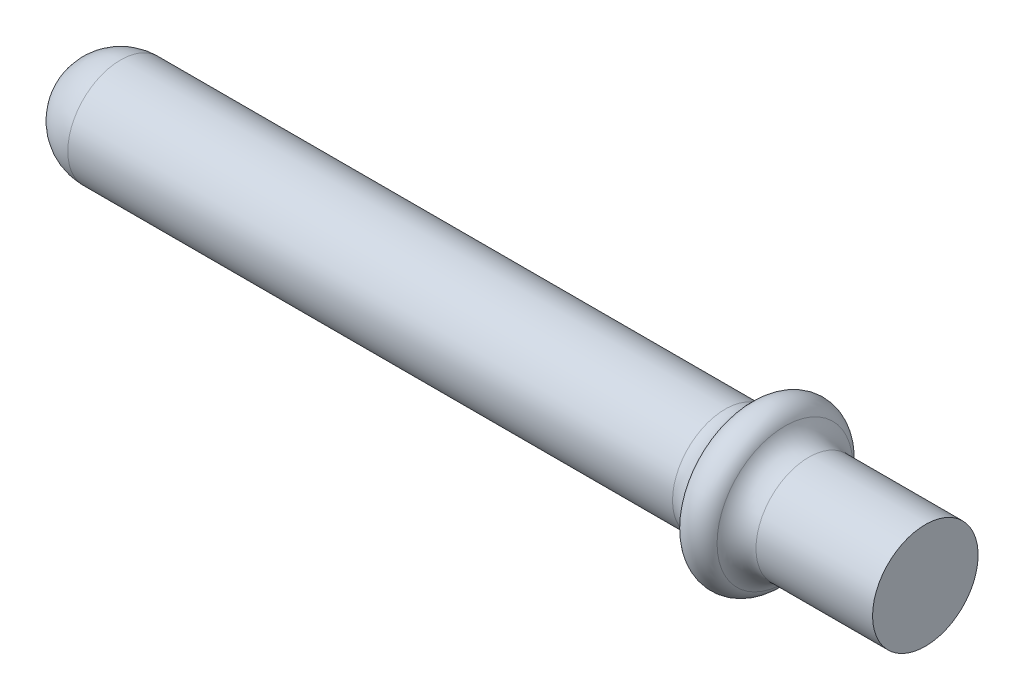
ISO-10303-21;
HEADER;
FILE_DESCRIPTION(('STEP AP214'),'2;1');
FILE_NAME('part.step','',(''),(''),'','','');
FILE_SCHEMA(('AUTOMOTIVE_DESIGN { 1 0 10303 214 1 1 1 1 }'));
ENDSEC;
DATA;
#1=APPLICATION_CONTEXT('core data for automotive mechanical design processes');
#2=APPLICATION_PROTOCOL_DEFINITION('international standard','automotive_design',2000,#1);
#3=PRODUCT_CONTEXT('',#1,'mechanical');
#4=PRODUCT('Part','Part','',(#3));
#5=PRODUCT_RELATED_PRODUCT_CATEGORY('part','',(#4));
#6=PRODUCT_DEFINITION_FORMATION('','',#4);
#7=PRODUCT_DEFINITION_CONTEXT('part definition',#1,'design');
#8=PRODUCT_DEFINITION('design','',#6,#7);
#9=PRODUCT_DEFINITION_SHAPE('','',#8);
#10=(LENGTH_UNIT() NAMED_UNIT(*) SI_UNIT(.MILLI.,.METRE.));
#11=(NAMED_UNIT(*) PLANE_ANGLE_UNIT() SI_UNIT($,.RADIAN.));
#12=(NAMED_UNIT(*) SI_UNIT($,.STERADIAN.) SOLID_ANGLE_UNIT());
#13=UNCERTAINTY_MEASURE_WITH_UNIT(LENGTH_MEASURE(1.E-05),#10,'distance_accuracy_value','');
#14=(GEOMETRIC_REPRESENTATION_CONTEXT(3) GLOBAL_UNCERTAINTY_ASSIGNED_CONTEXT((#13)) GLOBAL_UNIT_ASSIGNED_CONTEXT((#10,
#11,#12)) REPRESENTATION_CONTEXT('',''));
#15=CARTESIAN_POINT('',(0.,0.,0.));
#16=DIRECTION('',(0.,0.,1.));
#17=DIRECTION('',(1.,0.,0.));
#18=AXIS2_PLACEMENT_3D('',#15,#16,#17);
#19=CARTESIAN_POINT('',(0.,0.,0.));
#20=DIRECTION('',(-1.,0.,0.));
#21=DIRECTION('',(0.,0.,1.));
#22=AXIS2_PLACEMENT_3D('',#19,#20,#21);
#23=PLANE('',#22);
#24=CARTESIAN_POINT('',(0.,0.,0.));
#25=DIRECTION('',(-1.,0.,0.));
#26=DIRECTION('',(0.,0.,1.));
#27=AXIS2_PLACEMENT_3D('',#24,#25,#26);
#28=CIRCLE('',#27,3.99999999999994);
#29=CARTESIAN_POINT('',(0.,0.,3.99999999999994));
#30=VERTEX_POINT('',#29);
#31=EDGE_CURVE('E10',#30,#30,#28,.T.);
#32=ORIENTED_EDGE('',*,*,#31,.F.);
#33=EDGE_LOOP('',(#32));
#34=FACE_BOUND('',#33,.T.);
#35=ADVANCED_FACE('F24',(#34),#23,.F.);
#36=CARTESIAN_POINT('',(-67.9237669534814,0.,0.));
#37=DIRECTION('',(-1.,0.,0.));
#38=DIRECTION('',(0.,0.,1.));
#39=AXIS2_PLACEMENT_3D('',#36,#37,#38);
#40=CYLINDRICAL_SURFACE('',#39,3.99999999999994);
#41=CARTESIAN_POINT('',(-8.83772233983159,0.,0.));
#42=DIRECTION('',(-1.,0.,0.));
#43=DIRECTION('',(0.,0.,1.));
#44=AXIS2_PLACEMENT_3D('',#41,#42,#43);
#45=CIRCLE('',#44,3.99999999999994);
#46=CARTESIAN_POINT('',(-8.83772233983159,0.,3.99999999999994));
#47=VERTEX_POINT('',#46);
#48=EDGE_CURVE('E30',#47,#47,#45,.T.);
#49=ORIENTED_EDGE('',*,*,#48,.F.);
#50=EDGE_LOOP('',(#49));
#51=FACE_BOUND('',#50,.T.);
#52=ORIENTED_EDGE('',*,*,#31,.T.);
#53=EDGE_LOOP('',(#52));
#54=FACE_BOUND('',#53,.T.);
#55=ADVANCED_FACE('F72',(#51,#54),#40,.T.);
#56=CARTESIAN_POINT('',(-8.83772233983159,0.,0.));
#57=DIRECTION('',(-1.,0.,0.));
#58=DIRECTION('',(0.,0.,1.));
#59=AXIS2_PLACEMENT_3D('',#56,#57,#58);
#60=TOROIDAL_SURFACE('',#59,5.99999999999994,2.);
#61=CARTESIAN_POINT('',(-10.6447381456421,0.,0.));
#62=DIRECTION('',(-1.,0.,0.));
#63=DIRECTION('',(0.,0.,1.));
#64=AXIS2_PLACEMENT_3D('',#61,#62,#63);
#65=CIRCLE('',#64,5.14285714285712);
#66=CARTESIAN_POINT('',(-10.6447381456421,0.,5.14285714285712));
#67=VERTEX_POINT('',#66);
#68=EDGE_CURVE('E34',#67,#67,#65,.T.);
#69=ORIENTED_EDGE('',*,*,#68,.F.);
#70=EDGE_LOOP('',(#69));
#71=FACE_BOUND('',#70,.T.);
#72=ORIENTED_EDGE('',*,*,#48,.T.);
#73=EDGE_LOOP('',(#72));
#74=FACE_BOUND('',#73,.T.);
#75=ADVANCED_FACE('F67',(#71,#74),#60,.F.);
#76=CARTESIAN_POINT('',(-12.,0.,0.));
#77=DIRECTION('',(-1.,0.,0.));
#78=DIRECTION('',(0.,0.,1.));
#79=AXIS2_PLACEMENT_3D('',#76,#77,#78);
#80=TOROIDAL_SURFACE('',#79,4.5,1.5);
#81=CARTESIAN_POINT('',(-13.3552618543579,0.,0.));
#82=DIRECTION('',(-1.,0.,0.));
#83=DIRECTION('',(0.,0.,1.));
#84=AXIS2_PLACEMENT_3D('',#81,#82,#83);
#85=CIRCLE('',#84,5.14285714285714);
#86=CARTESIAN_POINT('',(-13.3552618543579,0.,5.14285714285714));
#87=VERTEX_POINT('',#86);
#88=EDGE_CURVE('E38',#87,#87,#85,.T.);
#89=ORIENTED_EDGE('',*,*,#88,.F.);
#90=EDGE_LOOP('',(#89));
#91=FACE_BOUND('',#90,.T.);
#92=ORIENTED_EDGE('',*,*,#68,.T.);
#93=EDGE_LOOP('',(#92));
#94=FACE_BOUND('',#93,.T.);
#95=ADVANCED_FACE('F61',(#91,#94),#80,.T.);
#96=CARTESIAN_POINT('',(-15.1622776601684,0.,0.));
#97=DIRECTION('',(-1.,0.,0.));
#98=DIRECTION('',(0.,0.,1.));
#99=AXIS2_PLACEMENT_3D('',#96,#97,#98);
#100=TOROIDAL_SURFACE('',#99,5.99999999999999,2.);
#101=CARTESIAN_POINT('',(-15.1622776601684,0.,0.));
#102=DIRECTION('',(-1.,0.,0.));
#103=DIRECTION('',(0.,0.,1.));
#104=AXIS2_PLACEMENT_3D('',#101,#102,#103);
#105=CIRCLE('',#104,4.);
#106=CARTESIAN_POINT('',(-15.1622776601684,0.,4.));
#107=VERTEX_POINT('',#106);
#108=EDGE_CURVE('E43',#107,#107,#105,.T.);
#109=ORIENTED_EDGE('',*,*,#108,.F.);
#110=EDGE_LOOP('',(#109));
#111=FACE_BOUND('',#110,.T.);
#112=ORIENTED_EDGE('',*,*,#88,.T.);
#113=EDGE_LOOP('',(#112));
#114=FACE_BOUND('',#113,.T.);
#115=ADVANCED_FACE('F55',(#111,#114),#100,.F.);
#116=CARTESIAN_POINT('',(-67.9237669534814,0.,0.));
#117=DIRECTION('',(-1.,0.,0.));
#118=DIRECTION('',(0.,0.,1.));
#119=AXIS2_PLACEMENT_3D('',#116,#117,#118);
#120=CYLINDRICAL_SURFACE('',#119,4.);
#121=CARTESIAN_POINT('',(-61.,0.,0.));
#122=DIRECTION('',(-1.,0.,0.));
#123=DIRECTION('',(0.,0.,1.));
#124=AXIS2_PLACEMENT_3D('',#121,#122,#123);
#125=CIRCLE('',#124,4.);
#126=CARTESIAN_POINT('',(-61.,0.,4.));
#127=VERTEX_POINT('',#126);
#128=EDGE_CURVE('E46',#127,#127,#125,.T.);
#129=ORIENTED_EDGE('',*,*,#128,.F.);
#130=EDGE_LOOP('',(#129));
#131=FACE_BOUND('',#130,.T.);
#132=ORIENTED_EDGE('',*,*,#108,.T.);
#133=EDGE_LOOP('',(#132));
#134=FACE_BOUND('',#133,.T.);
#135=ADVANCED_FACE('F52',(#131,#134),#120,.T.);
#136=CARTESIAN_POINT('',(-61.,0.,0.));
#137=DIRECTION('',(-1.,0.,0.));
#138=DIRECTION('',(0.,1.,0.));
#139=AXIS2_PLACEMENT_3D('',#136,#137,#138);
#140=SPHERICAL_SURFACE('',#139,4.);
#141=ORIENTED_EDGE('',*,*,#128,.T.);
#142=EDGE_LOOP('',(#141));
#143=FACE_BOUND('',#142,.T.);
#144=ADVANCED_FACE('F50',(#143),#140,.T.);
#145=CLOSED_SHELL('',(#35,#55,#75,#95,#115,#135,#144));
#146=MANIFOLD_SOLID_BREP('B2',#145);
#147=ADVANCED_BREP_SHAPE_REPRESENTATION('',(#18,#146),#14);
#148=SHAPE_DEFINITION_REPRESENTATION(#9,#147);
ENDSEC;
END-ISO-10303-21;
